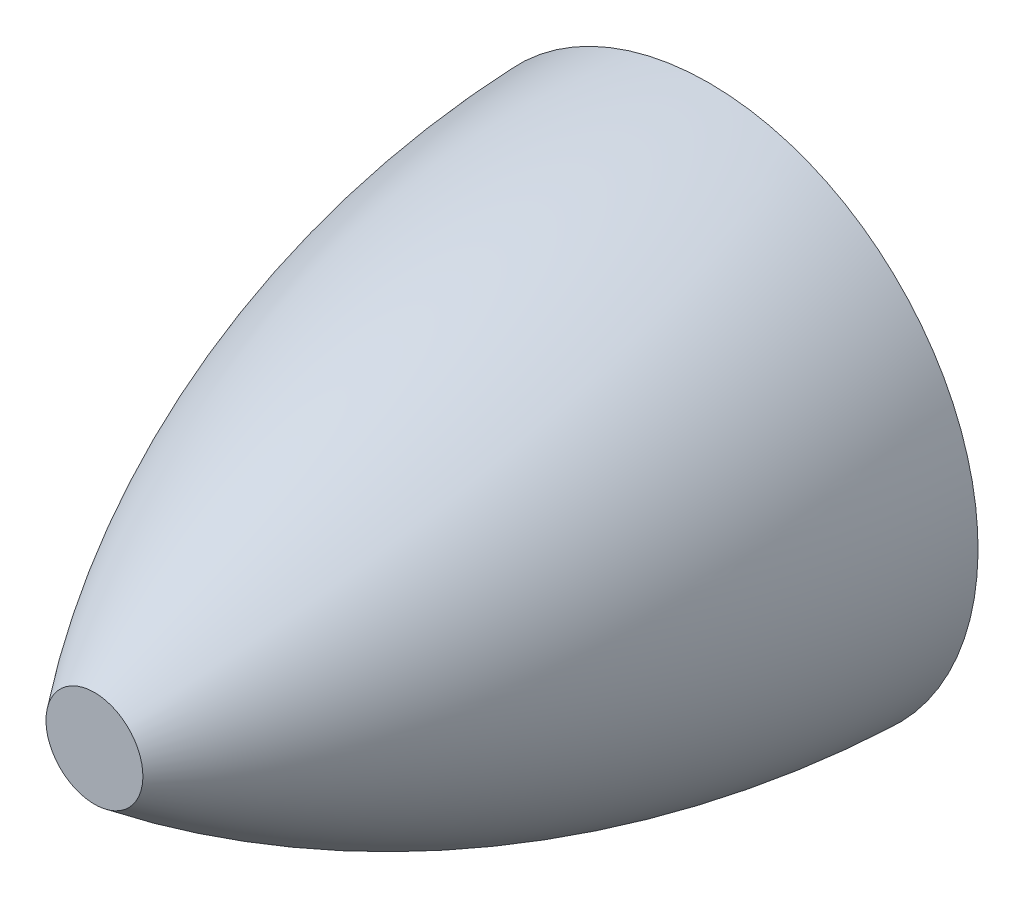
ISO-10303-21;
HEADER;
FILE_DESCRIPTION(('STEP AP214'),'2;1');
FILE_NAME('part.step','',(''),(''),'','','');
FILE_SCHEMA(('AUTOMOTIVE_DESIGN { 1 0 10303 214 1 1 1 1 }'));
ENDSEC;
DATA;
#1=APPLICATION_CONTEXT('core data for automotive mechanical design processes');
#2=APPLICATION_PROTOCOL_DEFINITION('international standard','automotive_design',2000,#1);
#3=PRODUCT_CONTEXT('',#1,'mechanical');
#4=PRODUCT('Part','Part','',(#3));
#5=PRODUCT_RELATED_PRODUCT_CATEGORY('part','',(#4));
#6=PRODUCT_DEFINITION_FORMATION('','',#4);
#7=PRODUCT_DEFINITION_CONTEXT('part definition',#1,'design');
#8=PRODUCT_DEFINITION('design','',#6,#7);
#9=PRODUCT_DEFINITION_SHAPE('','',#8);
#10=(LENGTH_UNIT() NAMED_UNIT(*) SI_UNIT(.MILLI.,.METRE.));
#11=(NAMED_UNIT(*) PLANE_ANGLE_UNIT() SI_UNIT($,.RADIAN.));
#12=(NAMED_UNIT(*) SI_UNIT($,.STERADIAN.) SOLID_ANGLE_UNIT());
#13=UNCERTAINTY_MEASURE_WITH_UNIT(LENGTH_MEASURE(1.E-05),#10,'distance_accuracy_value','');
#14=(GEOMETRIC_REPRESENTATION_CONTEXT(3) GLOBAL_UNCERTAINTY_ASSIGNED_CONTEXT((#13)) GLOBAL_UNIT_ASSIGNED_CONTEXT((#10,
#11,#12)) REPRESENTATION_CONTEXT('',''));
#15=CARTESIAN_POINT('',(0.,0.,0.));
#16=DIRECTION('',(0.,0.,1.));
#17=DIRECTION('',(1.,0.,0.));
#18=AXIS2_PLACEMENT_3D('',#15,#16,#17);
#19=CARTESIAN_POINT('',(0.,0.,8.));
#20=DIRECTION('',(0.,0.,-1.));
#21=DIRECTION('',(0.,1.,0.));
#22=AXIS2_PLACEMENT_3D('',#19,#20,#21);
#23=CYLINDRICAL_SURFACE('',#22,4.);
#24=CARTESIAN_POINT('',(0.,0.,8.));
#25=DIRECTION('',(0.,0.,-1.));
#26=DIRECTION('',(0.,1.,0.));
#27=AXIS2_PLACEMENT_3D('',#24,#25,#26);
#28=CIRCLE('',#27,4.);
#29=CARTESIAN_POINT('',(0.,4.,8.));
#30=VERTEX_POINT('',#29);
#31=EDGE_CURVE('E23',#30,#30,#28,.T.);
#32=ORIENTED_EDGE('',*,*,#31,.F.);
#33=EDGE_LOOP('',(#32));
#34=FACE_BOUND('',#33,.T.);
#35=CARTESIAN_POINT('',(0.,0.,0.));
#36=DIRECTION('',(0.,0.,-1.));
#37=DIRECTION('',(0.,1.,0.));
#38=AXIS2_PLACEMENT_3D('',#35,#36,#37);
#39=CIRCLE('',#38,4.);
#40=CARTESIAN_POINT('',(0.,4.,0.));
#41=VERTEX_POINT('',#40);
#42=EDGE_CURVE('E27',#41,#41,#39,.T.);
#43=ORIENTED_EDGE('',*,*,#42,.T.);
#44=EDGE_LOOP('',(#43));
#45=FACE_BOUND('',#44,.T.);
#46=ADVANCED_FACE('F12',(#34,#45),#23,.F.);
#47=CARTESIAN_POINT('',(0.,0.,8.));
#48=DIRECTION('',(0.,0.,-1.));
#49=DIRECTION('',(0.,1.,0.));
#50=AXIS2_PLACEMENT_3D('',#47,#48,#49);
#51=PLANE('',#50);
#52=ORIENTED_EDGE('',*,*,#31,.T.);
#53=EDGE_LOOP('',(#52));
#54=FACE_BOUND('',#53,.T.);
#55=ADVANCED_FACE('F44',(#54),#51,.T.);
#56=CARTESIAN_POINT('',(0.,0.,40.));
#57=DIRECTION('',(0.,0.,-1.));
#58=DIRECTION('',(0.,1.,0.));
#59=AXIS2_PLACEMENT_3D('',#56,#57,#58);
#60=PLANE('',#59);
#61=CARTESIAN_POINT('',(0.,0.,40.));
#62=DIRECTION('',(0.,0.,-1.));
#63=DIRECTION('',(0.,1.,0.));
#64=AXIS2_PLACEMENT_3D('',#61,#62,#63);
#65=CIRCLE('',#64,3.15315315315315);
#66=CARTESIAN_POINT('',(0.,3.15315315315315,40.));
#67=VERTEX_POINT('',#66);
#68=EDGE_CURVE('E8',#67,#67,#65,.T.);
#69=ORIENTED_EDGE('',*,*,#68,.F.);
#70=EDGE_LOOP('',(#69));
#71=FACE_BOUND('',#70,.T.);
#72=ADVANCED_FACE('F14',(#71),#60,.F.);
#73=CARTESIAN_POINT('',(0.,0.,-2.51783516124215));
#74=DIRECTION('',(0.,0.,-1.));
#75=DIRECTION('',(0.,1.,0.));
#76=AXIS2_PLACEMENT_3D('',#73,#74,#75);
#77=DEGENERATE_TOROIDAL_SURFACE('',#76,52.4547032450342,70.,.F.);
#78=ORIENTED_EDGE('',*,*,#68,.T.);
#79=EDGE_LOOP('',(#78));
#80=FACE_BOUND('',#79,.T.);
#81=CARTESIAN_POINT('',(0.,0.,0.));
#82=DIRECTION('',(0.,0.,-1.));
#83=DIRECTION('',(0.,1.,0.));
#84=AXIS2_PLACEMENT_3D('',#81,#82,#83);
#85=CIRCLE('',#84,17.5);
#86=CARTESIAN_POINT('',(0.,17.5,0.));
#87=VERTEX_POINT('',#86);
#88=EDGE_CURVE('E19',#87,#87,#85,.T.);
#89=ORIENTED_EDGE('',*,*,#88,.F.);
#90=EDGE_LOOP('',(#89));
#91=FACE_BOUND('',#90,.T.);
#92=ADVANCED_FACE('F36',(#80,#91),#77,.F.);
#93=CARTESIAN_POINT('',(17.5,0.,0.));
#94=DIRECTION('',(0.,0.,1.));
#95=DIRECTION('',(0.,-1.,0.));
#96=AXIS2_PLACEMENT_3D('',#93,#94,#95);
#97=PLANE('',#96);
#98=ORIENTED_EDGE('',*,*,#42,.F.);
#99=EDGE_LOOP('',(#98));
#100=FACE_BOUND('',#99,.T.);
#101=ORIENTED_EDGE('',*,*,#88,.T.);
#102=EDGE_LOOP('',(#101));
#103=FACE_BOUND('',#102,.T.);
#104=ADVANCED_FACE('F34',(#100,#103),#97,.F.);
#105=CLOSED_SHELL('',(#46,#55,#72,#92,#104));
#106=MANIFOLD_SOLID_BREP('B1',#105);
#107=ADVANCED_BREP_SHAPE_REPRESENTATION('',(#18,#106),#14);
#108=SHAPE_DEFINITION_REPRESENTATION(#9,#107);
ENDSEC;
END-ISO-10303-21;
